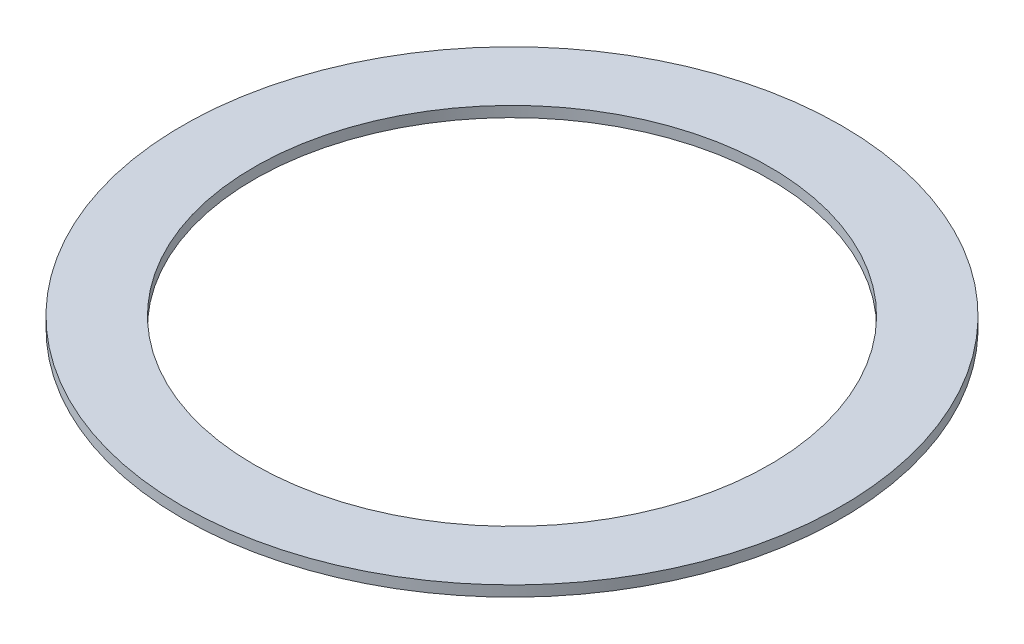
ISO-10303-21;
HEADER;
FILE_DESCRIPTION(('STEP AP214'),'2;1');
FILE_NAME('part.step','',(''),(''),'','','');
FILE_SCHEMA(('AUTOMOTIVE_DESIGN { 1 0 10303 214 1 1 1 1 }'));
ENDSEC;
DATA;
#1=APPLICATION_CONTEXT('core data for automotive mechanical design processes');
#2=APPLICATION_PROTOCOL_DEFINITION('international standard','automotive_design',2000,#1);
#3=PRODUCT_CONTEXT('',#1,'mechanical');
#4=PRODUCT('Part','Part','',(#3));
#5=PRODUCT_RELATED_PRODUCT_CATEGORY('part','',(#4));
#6=PRODUCT_DEFINITION_FORMATION('','',#4);
#7=PRODUCT_DEFINITION_CONTEXT('part definition',#1,'design');
#8=PRODUCT_DEFINITION('design','',#6,#7);
#9=PRODUCT_DEFINITION_SHAPE('','',#8);
#10=(LENGTH_UNIT() NAMED_UNIT(*) SI_UNIT(.MILLI.,.METRE.));
#11=(NAMED_UNIT(*) PLANE_ANGLE_UNIT() SI_UNIT($,.RADIAN.));
#12=(NAMED_UNIT(*) SI_UNIT($,.STERADIAN.) SOLID_ANGLE_UNIT());
#13=UNCERTAINTY_MEASURE_WITH_UNIT(LENGTH_MEASURE(1.E-05),#10,'distance_accuracy_value','');
#14=(GEOMETRIC_REPRESENTATION_CONTEXT(3) GLOBAL_UNCERTAINTY_ASSIGNED_CONTEXT((#13)) GLOBAL_UNIT_ASSIGNED_CONTEXT((#10,
#11,#12)) REPRESENTATION_CONTEXT('',''));
#15=CARTESIAN_POINT('',(0.,0.,0.));
#16=DIRECTION('',(0.,0.,1.));
#17=DIRECTION('',(1.,0.,0.));
#18=AXIS2_PLACEMENT_3D('',#15,#16,#17);
#19=CARTESIAN_POINT('',(0.,0.5,0.));
#20=DIRECTION('',(0.,1.,0.));
#21=DIRECTION('',(0.,0.,1.));
#22=AXIS2_PLACEMENT_3D('',#19,#20,#21);
#23=PLANE('',#22);
#24=CARTESIAN_POINT('',(0.,0.5,0.));
#25=DIRECTION('',(0.,1.,0.));
#26=DIRECTION('',(0.,0.,1.));
#27=AXIS2_PLACEMENT_3D('',#24,#25,#26);
#28=CIRCLE('',#27,31.);
#29=CARTESIAN_POINT('',(0.,0.5,31.));
#30=VERTEX_POINT('',#29);
#31=EDGE_CURVE('E10',#30,#30,#28,.T.);
#32=ORIENTED_EDGE('',*,*,#31,.T.);
#33=EDGE_LOOP('',(#32));
#34=FACE_BOUND('',#33,.T.);
#35=CARTESIAN_POINT('',(0.,0.5,0.));
#36=DIRECTION('',(0.,1.,0.));
#37=DIRECTION('',(0.,0.,1.));
#38=AXIS2_PLACEMENT_3D('',#35,#36,#37);
#39=CIRCLE('',#38,24.25);
#40=CARTESIAN_POINT('',(0.,0.5,24.25));
#41=VERTEX_POINT('',#40);
#42=EDGE_CURVE('E50',#41,#41,#39,.T.);
#43=ORIENTED_EDGE('',*,*,#42,.F.);
#44=EDGE_LOOP('',(#43));
#45=FACE_BOUND('',#44,.T.);
#46=ADVANCED_FACE('F37',(#34,#45),#23,.T.);
#47=CARTESIAN_POINT('',(0.,-0.5,0.));
#48=DIRECTION('',(0.,1.,0.));
#49=DIRECTION('',(0.,0.,1.));
#50=AXIS2_PLACEMENT_3D('',#47,#48,#49);
#51=PLANE('',#50);
#52=CARTESIAN_POINT('',(0.,-0.5,0.));
#53=DIRECTION('',(0.,1.,0.));
#54=DIRECTION('',(0.,0.,1.));
#55=AXIS2_PLACEMENT_3D('',#52,#53,#54);
#56=CIRCLE('',#55,31.);
#57=CARTESIAN_POINT('',(0.,-0.5,31.));
#58=VERTEX_POINT('',#57);
#59=EDGE_CURVE('E41',#58,#58,#56,.T.);
#60=ORIENTED_EDGE('',*,*,#59,.F.);
#61=EDGE_LOOP('',(#60));
#62=FACE_BOUND('',#61,.T.);
#63=CARTESIAN_POINT('',(0.,-0.5,0.));
#64=DIRECTION('',(0.,1.,0.));
#65=DIRECTION('',(0.,0.,1.));
#66=AXIS2_PLACEMENT_3D('',#63,#64,#65);
#67=CIRCLE('',#66,24.25);
#68=CARTESIAN_POINT('',(0.,-0.5,24.25));
#69=VERTEX_POINT('',#68);
#70=EDGE_CURVE('E52',#69,#69,#67,.T.);
#71=ORIENTED_EDGE('',*,*,#70,.T.);
#72=EDGE_LOOP('',(#71));
#73=FACE_BOUND('',#72,.T.);
#74=ADVANCED_FACE('F64',(#62,#73),#51,.F.);
#75=CARTESIAN_POINT('',(0.,0.5,0.));
#76=DIRECTION('',(0.,-1.,0.));
#77=DIRECTION('',(0.,0.,-1.));
#78=AXIS2_PLACEMENT_3D('',#75,#76,#77);
#79=CYLINDRICAL_SURFACE('',#78,31.);
#80=ORIENTED_EDGE('',*,*,#31,.F.);
#81=EDGE_LOOP('',(#80));
#82=FACE_BOUND('',#81,.T.);
#83=ORIENTED_EDGE('',*,*,#59,.T.);
#84=EDGE_LOOP('',(#83));
#85=FACE_BOUND('',#84,.T.);
#86=ADVANCED_FACE('F39',(#82,#85),#79,.T.);
#87=CARTESIAN_POINT('',(0.,0.5,0.));
#88=DIRECTION('',(0.,-1.,0.));
#89=DIRECTION('',(0.,0.,-1.));
#90=AXIS2_PLACEMENT_3D('',#87,#88,#89);
#91=CYLINDRICAL_SURFACE('',#90,24.25);
#92=ORIENTED_EDGE('',*,*,#42,.T.);
#93=EDGE_LOOP('',(#92));
#94=FACE_BOUND('',#93,.T.);
#95=ORIENTED_EDGE('',*,*,#70,.F.);
#96=EDGE_LOOP('',(#95));
#97=FACE_BOUND('',#96,.T.);
#98=ADVANCED_FACE('F60',(#94,#97),#91,.F.);
#99=CLOSED_SHELL('',(#46,#74,#86,#98));
#100=MANIFOLD_SOLID_BREP('B2',#99);
#101=ADVANCED_BREP_SHAPE_REPRESENTATION('',(#18,#100),#14);
#102=SHAPE_DEFINITION_REPRESENTATION(#9,#101);
ENDSEC;
END-ISO-10303-21;
